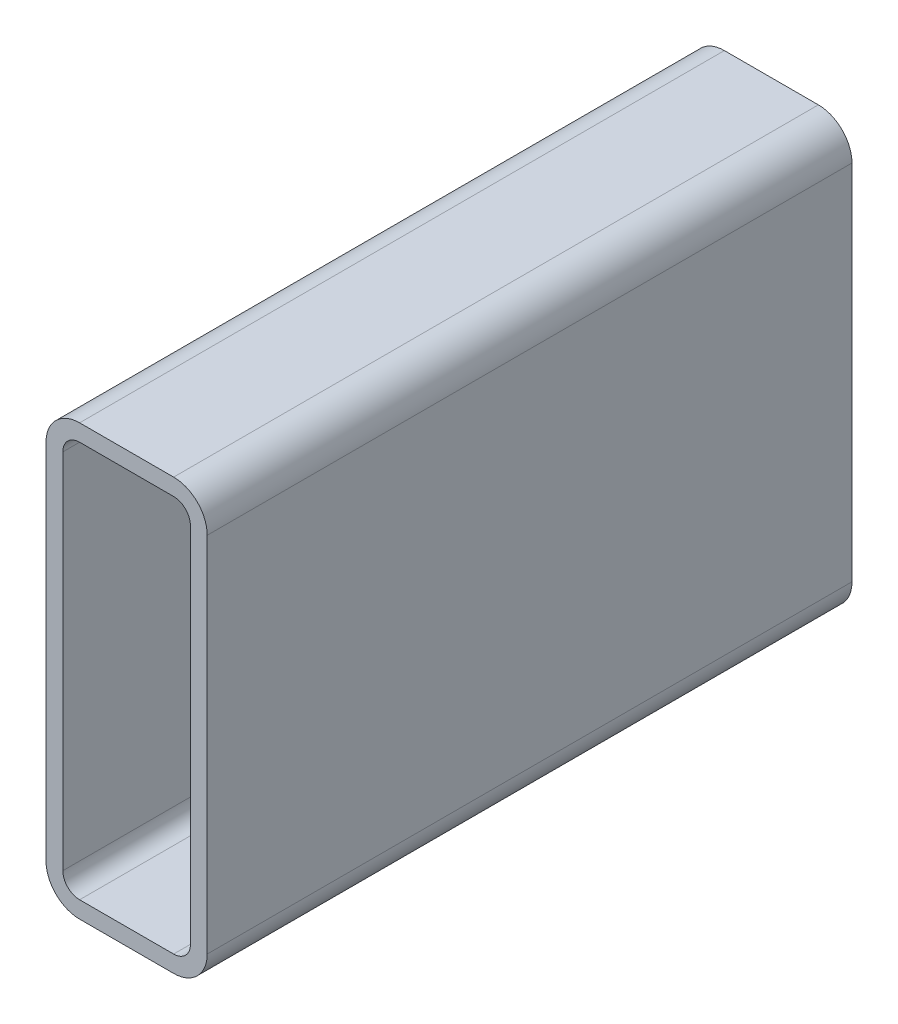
ISO-10303-21;
HEADER;
FILE_DESCRIPTION(('STEP AP214'),'2;1');
FILE_NAME('part.step','',(''),(''),'','','');
FILE_SCHEMA(('AUTOMOTIVE_DESIGN { 1 0 10303 214 1 1 1 1 }'));
ENDSEC;
DATA;
#1=APPLICATION_CONTEXT('core data for automotive mechanical design processes');
#2=APPLICATION_PROTOCOL_DEFINITION('international standard','automotive_design',2000,#1);
#3=PRODUCT_CONTEXT('',#1,'mechanical');
#4=PRODUCT('Part','Part','',(#3));
#5=PRODUCT_RELATED_PRODUCT_CATEGORY('part','',(#4));
#6=PRODUCT_DEFINITION_FORMATION('','',#4);
#7=PRODUCT_DEFINITION_CONTEXT('part definition',#1,'design');
#8=PRODUCT_DEFINITION('design','',#6,#7);
#9=PRODUCT_DEFINITION_SHAPE('','',#8);
#10=(LENGTH_UNIT() NAMED_UNIT(*) SI_UNIT(.MILLI.,.METRE.));
#11=(NAMED_UNIT(*) PLANE_ANGLE_UNIT() SI_UNIT($,.RADIAN.));
#12=(NAMED_UNIT(*) SI_UNIT($,.STERADIAN.) SOLID_ANGLE_UNIT());
#13=UNCERTAINTY_MEASURE_WITH_UNIT(LENGTH_MEASURE(1.E-05),#10,'distance_accuracy_value','');
#14=(GEOMETRIC_REPRESENTATION_CONTEXT(3) GLOBAL_UNCERTAINTY_ASSIGNED_CONTEXT((#13)) GLOBAL_UNIT_ASSIGNED_CONTEXT((#10,
#11,#12)) REPRESENTATION_CONTEXT('',''));
#15=CARTESIAN_POINT('',(0.,0.,0.));
#16=DIRECTION('',(0.,0.,1.));
#17=DIRECTION('',(1.,0.,0.));
#18=AXIS2_PLACEMENT_3D('',#15,#16,#17);
#19=CARTESIAN_POINT('',(18.3641160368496,189.291130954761,304.8));
#20=DIRECTION('',(0.,0.,1.));
#21=DIRECTION('',(1.,0.,0.));
#22=AXIS2_PLACEMENT_3D('',#19,#20,#21);
#23=PLANE('',#22);
#24=CARTESIAN_POINT('',(18.3641160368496,189.291130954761,304.8));
#25=DIRECTION('',(0.,0.,1.));
#26=DIRECTION('',(1.,0.,0.));
#27=AXIS2_PLACEMENT_3D('',#24,#25,#26);
#28=CIRCLE('',#27,15.875);
#29=CARTESIAN_POINT('',(18.3641160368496,205.166130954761,304.8));
#30=VERTEX_POINT('',#29);
#31=CARTESIAN_POINT('',(2.48911603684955,189.291130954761,304.8));
#32=VERTEX_POINT('',#31);
#33=EDGE_CURVE('E211',#30,#32,#28,.T.);
#34=ORIENTED_EDGE('',*,*,#33,.T.);
#35=DIRECTION('',(0.,-1.,0.));
#36=VECTOR('',#35,1.);
#37=CARTESIAN_POINT('',(2.48911603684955,17.8411309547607,304.8));
#38=LINE('',#37,#36);
#39=CARTESIAN_POINT('',(2.48911603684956,17.8411309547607,304.8));
#40=VERTEX_POINT('',#39);
#41=EDGE_CURVE('E214',#32,#40,#38,.T.);
#42=ORIENTED_EDGE('',*,*,#41,.T.);
#43=CARTESIAN_POINT('',(18.3641160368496,17.8411309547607,304.8));
#44=DIRECTION('',(0.,0.,1.));
#45=DIRECTION('',(1.,0.,0.));
#46=AXIS2_PLACEMENT_3D('',#43,#44,#45);
#47=CIRCLE('',#46,15.875);
#48=CARTESIAN_POINT('',(18.3641160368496,1.96613095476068,304.8));
#49=VERTEX_POINT('',#48);
#50=EDGE_CURVE('E217',#40,#49,#47,.T.);
#51=ORIENTED_EDGE('',*,*,#50,.T.);
#52=DIRECTION('',(1.,0.,0.));
#53=VECTOR('',#52,1.);
#54=CARTESIAN_POINT('',(62.8141160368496,1.96613095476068,304.8));
#55=LINE('',#54,#53);
#56=CARTESIAN_POINT('',(62.8141160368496,1.96613095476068,304.8));
#57=VERTEX_POINT('',#56);
#58=EDGE_CURVE('E219',#49,#57,#55,.T.);
#59=ORIENTED_EDGE('',*,*,#58,.T.);
#60=CARTESIAN_POINT('',(62.8141160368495,17.8411309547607,304.8));
#61=DIRECTION('',(0.,0.,1.));
#62=DIRECTION('',(1.,0.,0.));
#63=AXIS2_PLACEMENT_3D('',#60,#61,#62);
#64=CIRCLE('',#63,15.875);
#65=CARTESIAN_POINT('',(78.6891160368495,17.8411309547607,304.8));
#66=VERTEX_POINT('',#65);
#67=EDGE_CURVE('E221',#57,#66,#64,.T.);
#68=ORIENTED_EDGE('',*,*,#67,.T.);
#69=DIRECTION('',(0.,1.,0.));
#70=VECTOR('',#69,1.);
#71=CARTESIAN_POINT('',(78.6891160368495,189.291130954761,304.8));
#72=LINE('',#71,#70);
#73=CARTESIAN_POINT('',(78.6891160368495,189.291130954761,304.8));
#74=VERTEX_POINT('',#73);
#75=EDGE_CURVE('E223',#66,#74,#72,.T.);
#76=ORIENTED_EDGE('',*,*,#75,.T.);
#77=CARTESIAN_POINT('',(62.8141160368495,189.291130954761,304.8));
#78=DIRECTION('',(0.,0.,1.));
#79=DIRECTION('',(1.,0.,0.));
#80=AXIS2_PLACEMENT_3D('',#77,#78,#79);
#81=CIRCLE('',#80,15.875);
#82=CARTESIAN_POINT('',(62.8141160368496,205.166130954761,304.8));
#83=VERTEX_POINT('',#82);
#84=EDGE_CURVE('E225',#74,#83,#81,.T.);
#85=ORIENTED_EDGE('',*,*,#84,.T.);
#86=DIRECTION('',(-1.,0.,0.));
#87=VECTOR('',#86,1.);
#88=CARTESIAN_POINT('',(18.3641160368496,205.166130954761,304.8));
#89=LINE('',#88,#87);
#90=EDGE_CURVE('E227',#83,#30,#89,.T.);
#91=ORIENTED_EDGE('',*,*,#90,.T.);
#92=EDGE_LOOP('',(#34,#42,#51,#59,#68,#76,#85,#91));
#93=FACE_BOUND('',#92,.T.);
#94=DIRECTION('',(0.,-1.,0.));
#95=VECTOR('',#94,1.);
#96=CARTESIAN_POINT('',(10.4266160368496,17.8411309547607,304.8));
#97=LINE('',#96,#95);
#98=CARTESIAN_POINT('',(10.4266160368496,189.291130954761,304.8));
#99=VERTEX_POINT('',#98);
#100=CARTESIAN_POINT('',(10.4266160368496,17.8411309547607,304.8));
#101=VERTEX_POINT('',#100);
#102=EDGE_CURVE('E154',#99,#101,#97,.T.);
#103=ORIENTED_EDGE('',*,*,#102,.F.);
#104=CARTESIAN_POINT('',(18.3641160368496,189.291130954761,304.8));
#105=DIRECTION('',(0.,0.,1.));
#106=DIRECTION('',(1.,0.,0.));
#107=AXIS2_PLACEMENT_3D('',#104,#105,#106);
#108=CIRCLE('',#107,7.9375);
#109=CARTESIAN_POINT('',(18.3641160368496,197.228630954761,304.8));
#110=VERTEX_POINT('',#109);
#111=EDGE_CURVE('E146',#110,#99,#108,.T.);
#112=ORIENTED_EDGE('',*,*,#111,.F.);
#113=DIRECTION('',(-1.,0.,0.));
#114=VECTOR('',#113,1.);
#115=CARTESIAN_POINT('',(18.3641160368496,197.228630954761,304.8));
#116=LINE('',#115,#114);
#117=CARTESIAN_POINT('',(62.8141160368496,197.228630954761,304.8));
#118=VERTEX_POINT('',#117);
#119=EDGE_CURVE('E179',#118,#110,#116,.T.);
#120=ORIENTED_EDGE('',*,*,#119,.F.);
#121=CARTESIAN_POINT('',(62.8141160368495,189.291130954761,304.8));
#122=DIRECTION('',(0.,0.,1.));
#123=DIRECTION('',(1.,0.,0.));
#124=AXIS2_PLACEMENT_3D('',#121,#122,#123);
#125=CIRCLE('',#124,7.9375);
#126=CARTESIAN_POINT('',(70.7516160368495,189.291130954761,304.8));
#127=VERTEX_POINT('',#126);
#128=EDGE_CURVE('E177',#127,#118,#125,.T.);
#129=ORIENTED_EDGE('',*,*,#128,.F.);
#130=DIRECTION('',(0.,1.,0.));
#131=VECTOR('',#130,1.);
#132=CARTESIAN_POINT('',(70.7516160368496,189.291130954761,304.8));
#133=LINE('',#132,#131);
#134=CARTESIAN_POINT('',(70.7516160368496,17.8411309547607,304.8));
#135=VERTEX_POINT('',#134);
#136=EDGE_CURVE('E175',#135,#127,#133,.T.);
#137=ORIENTED_EDGE('',*,*,#136,.F.);
#138=CARTESIAN_POINT('',(62.8141160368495,17.8411309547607,304.8));
#139=DIRECTION('',(0.,0.,1.));
#140=DIRECTION('',(1.,0.,0.));
#141=AXIS2_PLACEMENT_3D('',#138,#139,#140);
#142=CIRCLE('',#141,7.93750000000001);
#143=CARTESIAN_POINT('',(62.8141160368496,9.90363095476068,304.8));
#144=VERTEX_POINT('',#143);
#145=EDGE_CURVE('E173',#144,#135,#142,.T.);
#146=ORIENTED_EDGE('',*,*,#145,.F.);
#147=DIRECTION('',(1.,0.,0.));
#148=VECTOR('',#147,1.);
#149=CARTESIAN_POINT('',(62.8141160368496,9.90363095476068,304.8));
#150=LINE('',#149,#148);
#151=CARTESIAN_POINT('',(18.3641160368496,9.90363095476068,304.8));
#152=VERTEX_POINT('',#151);
#153=EDGE_CURVE('E169',#152,#144,#150,.T.);
#154=ORIENTED_EDGE('',*,*,#153,.F.);
#155=CARTESIAN_POINT('',(18.3641160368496,17.8411309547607,304.8));
#156=DIRECTION('',(0.,0.,1.));
#157=DIRECTION('',(1.,0.,0.));
#158=AXIS2_PLACEMENT_3D('',#155,#156,#157);
#159=CIRCLE('',#158,7.9375);
#160=EDGE_CURVE('E167',#101,#152,#159,.T.);
#161=ORIENTED_EDGE('',*,*,#160,.F.);
#162=EDGE_LOOP('',(#103,#112,#120,#129,#137,#146,#154,#161));
#163=FACE_BOUND('',#162,.T.);
#164=ADVANCED_FACE('F33',(#93,#163),#23,.T.);
#165=CARTESIAN_POINT('',(18.3641160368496,189.291130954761,0.));
#166=DIRECTION('',(0.,0.,1.));
#167=DIRECTION('',(1.,0.,0.));
#168=AXIS2_PLACEMENT_3D('',#165,#166,#167);
#169=PLANE('',#168);
#170=CARTESIAN_POINT('',(18.3641160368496,189.291130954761,0.));
#171=DIRECTION('',(0.,0.,1.));
#172=DIRECTION('',(1.,0.,0.));
#173=AXIS2_PLACEMENT_3D('',#170,#171,#172);
#174=CIRCLE('',#173,15.875);
#175=CARTESIAN_POINT('',(18.3641160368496,205.166130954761,0.));
#176=VERTEX_POINT('',#175);
#177=CARTESIAN_POINT('',(2.48911603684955,189.291130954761,0.));
#178=VERTEX_POINT('',#177);
#179=EDGE_CURVE('E162',#176,#178,#174,.T.);
#180=ORIENTED_EDGE('',*,*,#179,.F.);
#181=DIRECTION('',(-1.,0.,0.));
#182=VECTOR('',#181,1.);
#183=CARTESIAN_POINT('',(18.3641160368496,205.166130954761,0.));
#184=LINE('',#183,#182);
#185=CARTESIAN_POINT('',(62.8141160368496,205.166130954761,0.));
#186=VERTEX_POINT('',#185);
#187=EDGE_CURVE('E215',#186,#176,#184,.T.);
#188=ORIENTED_EDGE('',*,*,#187,.F.);
#189=CARTESIAN_POINT('',(62.8141160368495,189.291130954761,0.));
#190=DIRECTION('',(0.,0.,1.));
#191=DIRECTION('',(1.,0.,0.));
#192=AXIS2_PLACEMENT_3D('',#189,#190,#191);
#193=CIRCLE('',#192,15.875);
#194=CARTESIAN_POINT('',(78.6891160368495,189.291130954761,0.));
#195=VERTEX_POINT('',#194);
#196=EDGE_CURVE('E242',#195,#186,#193,.T.);
#197=ORIENTED_EDGE('',*,*,#196,.F.);
#198=DIRECTION('',(0.,1.,0.));
#199=VECTOR('',#198,1.);
#200=CARTESIAN_POINT('',(78.6891160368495,189.291130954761,0.));
#201=LINE('',#200,#199);
#202=CARTESIAN_POINT('',(78.6891160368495,17.8411309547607,0.));
#203=VERTEX_POINT('',#202);
#204=EDGE_CURVE('E240',#203,#195,#201,.T.);
#205=ORIENTED_EDGE('',*,*,#204,.F.);
#206=CARTESIAN_POINT('',(62.8141160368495,17.8411309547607,0.));
#207=DIRECTION('',(0.,0.,1.));
#208=DIRECTION('',(1.,0.,0.));
#209=AXIS2_PLACEMENT_3D('',#206,#207,#208);
#210=CIRCLE('',#209,15.875);
#211=CARTESIAN_POINT('',(62.8141160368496,1.96613095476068,0.));
#212=VERTEX_POINT('',#211);
#213=EDGE_CURVE('E238',#212,#203,#210,.T.);
#214=ORIENTED_EDGE('',*,*,#213,.F.);
#215=DIRECTION('',(1.,0.,0.));
#216=VECTOR('',#215,1.);
#217=CARTESIAN_POINT('',(62.8141160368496,1.96613095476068,0.));
#218=LINE('',#217,#216);
#219=CARTESIAN_POINT('',(18.3641160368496,1.96613095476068,0.));
#220=VERTEX_POINT('',#219);
#221=EDGE_CURVE('E236',#220,#212,#218,.T.);
#222=ORIENTED_EDGE('',*,*,#221,.F.);
#223=CARTESIAN_POINT('',(18.3641160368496,17.8411309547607,0.));
#224=DIRECTION('',(0.,0.,1.));
#225=DIRECTION('',(1.,0.,0.));
#226=AXIS2_PLACEMENT_3D('',#223,#224,#225);
#227=CIRCLE('',#226,15.875);
#228=CARTESIAN_POINT('',(2.48911603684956,17.8411309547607,0.));
#229=VERTEX_POINT('',#228);
#230=EDGE_CURVE('E234',#229,#220,#227,.T.);
#231=ORIENTED_EDGE('',*,*,#230,.F.);
#232=DIRECTION('',(0.,-1.,0.));
#233=VECTOR('',#232,1.);
#234=CARTESIAN_POINT('',(2.48911603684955,17.8411309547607,0.));
#235=LINE('',#234,#233);
#236=EDGE_CURVE('E232',#178,#229,#235,.T.);
#237=ORIENTED_EDGE('',*,*,#236,.F.);
#238=EDGE_LOOP('',(#180,#188,#197,#205,#214,#222,#231,#237));
#239=FACE_BOUND('',#238,.T.);
#240=CARTESIAN_POINT('',(18.3641160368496,189.291130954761,0.));
#241=DIRECTION('',(0.,0.,1.));
#242=DIRECTION('',(1.,0.,0.));
#243=AXIS2_PLACEMENT_3D('',#240,#241,#242);
#244=CIRCLE('',#243,7.9375);
#245=CARTESIAN_POINT('',(18.3641160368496,197.228630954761,0.));
#246=VERTEX_POINT('',#245);
#247=CARTESIAN_POINT('',(10.4266160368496,189.291130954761,0.));
#248=VERTEX_POINT('',#247);
#249=EDGE_CURVE('E56',#246,#248,#244,.T.);
#250=ORIENTED_EDGE('',*,*,#249,.T.);
#251=DIRECTION('',(0.,-1.,0.));
#252=VECTOR('',#251,1.);
#253=CARTESIAN_POINT('',(10.4266160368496,17.8411309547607,0.));
#254=LINE('',#253,#252);
#255=CARTESIAN_POINT('',(10.4266160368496,17.8411309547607,0.));
#256=VERTEX_POINT('',#255);
#257=EDGE_CURVE('E161',#248,#256,#254,.T.);
#258=ORIENTED_EDGE('',*,*,#257,.T.);
#259=CARTESIAN_POINT('',(18.3641160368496,17.8411309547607,0.));
#260=DIRECTION('',(0.,0.,1.));
#261=DIRECTION('',(1.,0.,0.));
#262=AXIS2_PLACEMENT_3D('',#259,#260,#261);
#263=CIRCLE('',#262,7.9375);
#264=CARTESIAN_POINT('',(18.3641160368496,9.90363095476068,0.));
#265=VERTEX_POINT('',#264);
#266=EDGE_CURVE('E183',#256,#265,#263,.T.);
#267=ORIENTED_EDGE('',*,*,#266,.T.);
#268=DIRECTION('',(1.,0.,0.));
#269=VECTOR('',#268,1.);
#270=CARTESIAN_POINT('',(62.8141160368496,9.90363095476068,0.));
#271=LINE('',#270,#269);
#272=CARTESIAN_POINT('',(62.8141160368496,9.90363095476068,0.));
#273=VERTEX_POINT('',#272);
#274=EDGE_CURVE('E186',#265,#273,#271,.T.);
#275=ORIENTED_EDGE('',*,*,#274,.T.);
#276=CARTESIAN_POINT('',(62.8141160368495,17.8411309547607,0.));
#277=DIRECTION('',(0.,0.,1.));
#278=DIRECTION('',(1.,0.,0.));
#279=AXIS2_PLACEMENT_3D('',#276,#277,#278);
#280=CIRCLE('',#279,7.93750000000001);
#281=CARTESIAN_POINT('',(70.7516160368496,17.8411309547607,0.));
#282=VERTEX_POINT('',#281);
#283=EDGE_CURVE('E189',#273,#282,#280,.T.);
#284=ORIENTED_EDGE('',*,*,#283,.T.);
#285=DIRECTION('',(0.,1.,0.));
#286=VECTOR('',#285,1.);
#287=CARTESIAN_POINT('',(70.7516160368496,189.291130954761,0.));
#288=LINE('',#287,#286);
#289=CARTESIAN_POINT('',(70.7516160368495,189.291130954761,0.));
#290=VERTEX_POINT('',#289);
#291=EDGE_CURVE('E192',#282,#290,#288,.T.);
#292=ORIENTED_EDGE('',*,*,#291,.T.);
#293=CARTESIAN_POINT('',(62.8141160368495,189.291130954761,0.));
#294=DIRECTION('',(0.,0.,1.));
#295=DIRECTION('',(1.,0.,0.));
#296=AXIS2_PLACEMENT_3D('',#293,#294,#295);
#297=CIRCLE('',#296,7.9375);
#298=CARTESIAN_POINT('',(62.8141160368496,197.228630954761,0.));
#299=VERTEX_POINT('',#298);
#300=EDGE_CURVE('E195',#290,#299,#297,.T.);
#301=ORIENTED_EDGE('',*,*,#300,.T.);
#302=DIRECTION('',(-1.,0.,0.));
#303=VECTOR('',#302,1.);
#304=CARTESIAN_POINT('',(18.3641160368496,197.228630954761,0.));
#305=LINE('',#304,#303);
#306=EDGE_CURVE('E155',#299,#246,#305,.T.);
#307=ORIENTED_EDGE('',*,*,#306,.T.);
#308=EDGE_LOOP('',(#250,#258,#267,#275,#284,#292,#301,#307));
#309=FACE_BOUND('',#308,.T.);
#310=ADVANCED_FACE('F272',(#239,#309),#169,.F.);
#311=CARTESIAN_POINT('',(18.3641160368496,189.291130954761,304.8));
#312=DIRECTION('',(0.,0.,-1.));
#313=DIRECTION('',(-1.,0.,0.));
#314=AXIS2_PLACEMENT_3D('',#311,#312,#313);
#315=CYLINDRICAL_SURFACE('',#314,15.875);
#316=ORIENTED_EDGE('',*,*,#179,.T.);
#317=DIRECTION('',(0.,0.,-1.));
#318=VECTOR('',#317,1.);
#319=CARTESIAN_POINT('',(2.48911603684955,189.291130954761,304.8));
#320=LINE('',#319,#318);
#321=EDGE_CURVE('E11',#32,#178,#320,.T.);
#322=ORIENTED_EDGE('',*,*,#321,.F.);
#323=ORIENTED_EDGE('',*,*,#33,.F.);
#324=DIRECTION('',(0.,0.,-1.));
#325=VECTOR('',#324,1.);
#326=CARTESIAN_POINT('',(18.3641160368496,205.166130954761,304.8));
#327=LINE('',#326,#325);
#328=EDGE_CURVE('E229',#30,#176,#327,.T.);
#329=ORIENTED_EDGE('',*,*,#328,.T.);
#330=EDGE_LOOP('',(#316,#322,#323,#329));
#331=FACE_BOUND('',#330,.T.);
#332=ADVANCED_FACE('F35',(#331),#315,.T.);
#333=CARTESIAN_POINT('',(2.48911603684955,17.8411309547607,304.8));
#334=DIRECTION('',(1.,0.,0.));
#335=DIRECTION('',(0.,0.,-1.));
#336=AXIS2_PLACEMENT_3D('',#333,#334,#335);
#337=PLANE('',#336);
#338=ORIENTED_EDGE('',*,*,#236,.T.);
#339=DIRECTION('',(0.,0.,-1.));
#340=VECTOR('',#339,1.);
#341=CARTESIAN_POINT('',(2.48911603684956,17.8411309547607,304.8));
#342=LINE('',#341,#340);
#343=EDGE_CURVE('E41',#40,#229,#342,.T.);
#344=ORIENTED_EDGE('',*,*,#343,.F.);
#345=ORIENTED_EDGE('',*,*,#41,.F.);
#346=ORIENTED_EDGE('',*,*,#321,.T.);
#347=EDGE_LOOP('',(#338,#344,#345,#346));
#348=FACE_BOUND('',#347,.T.);
#349=ADVANCED_FACE('F289',(#348),#337,.F.);
#350=CARTESIAN_POINT('',(18.3641160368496,17.8411309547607,304.8));
#351=DIRECTION('',(0.,0.,-1.));
#352=DIRECTION('',(-1.,0.,0.));
#353=AXIS2_PLACEMENT_3D('',#350,#351,#352);
#354=CYLINDRICAL_SURFACE('',#353,15.875);
#355=ORIENTED_EDGE('',*,*,#230,.T.);
#356=DIRECTION('',(0.,0.,-1.));
#357=VECTOR('',#356,1.);
#358=CARTESIAN_POINT('',(18.3641160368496,1.96613095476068,304.8));
#359=LINE('',#358,#357);
#360=EDGE_CURVE('E259',#49,#220,#359,.T.);
#361=ORIENTED_EDGE('',*,*,#360,.F.);
#362=ORIENTED_EDGE('',*,*,#50,.F.);
#363=ORIENTED_EDGE('',*,*,#343,.T.);
#364=EDGE_LOOP('',(#355,#361,#362,#363));
#365=FACE_BOUND('',#364,.T.);
#366=ADVANCED_FACE('F266',(#365),#354,.T.);
#367=CARTESIAN_POINT('',(62.8141160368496,1.96613095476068,304.8));
#368=DIRECTION('',(0.,1.,0.));
#369=DIRECTION('',(0.,0.,1.));
#370=AXIS2_PLACEMENT_3D('',#367,#368,#369);
#371=PLANE('',#370);
#372=ORIENTED_EDGE('',*,*,#221,.T.);
#373=DIRECTION('',(0.,0.,-1.));
#374=VECTOR('',#373,1.);
#375=CARTESIAN_POINT('',(62.8141160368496,1.96613095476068,304.8));
#376=LINE('',#375,#374);
#377=EDGE_CURVE('E256',#57,#212,#376,.T.);
#378=ORIENTED_EDGE('',*,*,#377,.F.);
#379=ORIENTED_EDGE('',*,*,#58,.F.);
#380=ORIENTED_EDGE('',*,*,#360,.T.);
#381=EDGE_LOOP('',(#372,#378,#379,#380));
#382=FACE_BOUND('',#381,.T.);
#383=ADVANCED_FACE('F278',(#382),#371,.F.);
#384=CARTESIAN_POINT('',(62.8141160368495,17.8411309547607,304.8));
#385=DIRECTION('',(0.,0.,-1.));
#386=DIRECTION('',(-1.,0.,0.));
#387=AXIS2_PLACEMENT_3D('',#384,#385,#386);
#388=CYLINDRICAL_SURFACE('',#387,15.875);
#389=ORIENTED_EDGE('',*,*,#213,.T.);
#390=DIRECTION('',(0.,0.,-1.));
#391=VECTOR('',#390,1.);
#392=CARTESIAN_POINT('',(78.6891160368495,17.8411309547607,304.8));
#393=LINE('',#392,#391);
#394=EDGE_CURVE('E253',#66,#203,#393,.T.);
#395=ORIENTED_EDGE('',*,*,#394,.F.);
#396=ORIENTED_EDGE('',*,*,#67,.F.);
#397=ORIENTED_EDGE('',*,*,#377,.T.);
#398=EDGE_LOOP('',(#389,#395,#396,#397));
#399=FACE_BOUND('',#398,.T.);
#400=ADVANCED_FACE('F282',(#399),#388,.T.);
#401=CARTESIAN_POINT('',(78.6891160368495,189.291130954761,304.8));
#402=DIRECTION('',(-1.,0.,0.));
#403=DIRECTION('',(0.,0.,1.));
#404=AXIS2_PLACEMENT_3D('',#401,#402,#403);
#405=PLANE('',#404);
#406=ORIENTED_EDGE('',*,*,#204,.T.);
#407=DIRECTION('',(0.,0.,-1.));
#408=VECTOR('',#407,1.);
#409=CARTESIAN_POINT('',(78.6891160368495,189.291130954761,304.8));
#410=LINE('',#409,#408);
#411=EDGE_CURVE('E250',#74,#195,#410,.T.);
#412=ORIENTED_EDGE('',*,*,#411,.F.);
#413=ORIENTED_EDGE('',*,*,#75,.F.);
#414=ORIENTED_EDGE('',*,*,#394,.T.);
#415=EDGE_LOOP('',(#406,#412,#413,#414));
#416=FACE_BOUND('',#415,.T.);
#417=ADVANCED_FACE('F302',(#416),#405,.F.);
#418=CARTESIAN_POINT('',(62.8141160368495,189.291130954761,304.8));
#419=DIRECTION('',(0.,0.,-1.));
#420=DIRECTION('',(-1.,0.,0.));
#421=AXIS2_PLACEMENT_3D('',#418,#419,#420);
#422=CYLINDRICAL_SURFACE('',#421,15.875);
#423=ORIENTED_EDGE('',*,*,#196,.T.);
#424=DIRECTION('',(0.,0.,-1.));
#425=VECTOR('',#424,1.);
#426=CARTESIAN_POINT('',(62.8141160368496,205.166130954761,304.8));
#427=LINE('',#426,#425);
#428=EDGE_CURVE('E247',#83,#186,#427,.T.);
#429=ORIENTED_EDGE('',*,*,#428,.F.);
#430=ORIENTED_EDGE('',*,*,#84,.F.);
#431=ORIENTED_EDGE('',*,*,#411,.T.);
#432=EDGE_LOOP('',(#423,#429,#430,#431));
#433=FACE_BOUND('',#432,.T.);
#434=ADVANCED_FACE('F300',(#433),#422,.T.);
#435=CARTESIAN_POINT('',(18.3641160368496,205.166130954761,304.8));
#436=DIRECTION('',(0.,-1.,0.));
#437=DIRECTION('',(0.,0.,-1.));
#438=AXIS2_PLACEMENT_3D('',#435,#436,#437);
#439=PLANE('',#438);
#440=ORIENTED_EDGE('',*,*,#187,.T.);
#441=ORIENTED_EDGE('',*,*,#328,.F.);
#442=ORIENTED_EDGE('',*,*,#90,.F.);
#443=ORIENTED_EDGE('',*,*,#428,.T.);
#444=EDGE_LOOP('',(#440,#441,#442,#443));
#445=FACE_BOUND('',#444,.T.);
#446=ADVANCED_FACE('F295',(#445),#439,.F.);
#447=CARTESIAN_POINT('',(18.3641160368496,189.291130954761,304.8));
#448=DIRECTION('',(0.,0.,-1.));
#449=DIRECTION('',(-1.,0.,0.));
#450=AXIS2_PLACEMENT_3D('',#447,#448,#449);
#451=CYLINDRICAL_SURFACE('',#450,7.9375);
#452=ORIENTED_EDGE('',*,*,#249,.F.);
#453=DIRECTION('',(0.,0.,-1.));
#454=VECTOR('',#453,1.);
#455=CARTESIAN_POINT('',(18.3641160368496,197.228630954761,304.8));
#456=LINE('',#455,#454);
#457=EDGE_CURVE('E150',#110,#246,#456,.T.);
#458=ORIENTED_EDGE('',*,*,#457,.F.);
#459=ORIENTED_EDGE('',*,*,#111,.T.);
#460=DIRECTION('',(0.,0.,-1.));
#461=VECTOR('',#460,1.);
#462=CARTESIAN_POINT('',(10.4266160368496,189.291130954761,304.8));
#463=LINE('',#462,#461);
#464=EDGE_CURVE('E149',#99,#248,#463,.T.);
#465=ORIENTED_EDGE('',*,*,#464,.T.);
#466=EDGE_LOOP('',(#452,#458,#459,#465));
#467=FACE_BOUND('',#466,.T.);
#468=ADVANCED_FACE('F148',(#467),#451,.F.);
#469=CARTESIAN_POINT('',(10.4266160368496,17.8411309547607,304.8));
#470=DIRECTION('',(1.,0.,0.));
#471=DIRECTION('',(0.,0.,-1.));
#472=AXIS2_PLACEMENT_3D('',#469,#470,#471);
#473=PLANE('',#472);
#474=ORIENTED_EDGE('',*,*,#257,.F.);
#475=ORIENTED_EDGE('',*,*,#464,.F.);
#476=ORIENTED_EDGE('',*,*,#102,.T.);
#477=DIRECTION('',(0.,0.,-1.));
#478=VECTOR('',#477,1.);
#479=CARTESIAN_POINT('',(10.4266160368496,17.8411309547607,304.8));
#480=LINE('',#479,#478);
#481=EDGE_CURVE('E163',#101,#256,#480,.T.);
#482=ORIENTED_EDGE('',*,*,#481,.T.);
#483=EDGE_LOOP('',(#474,#475,#476,#482));
#484=FACE_BOUND('',#483,.T.);
#485=ADVANCED_FACE('F158',(#484),#473,.T.);
#486=CARTESIAN_POINT('',(18.3641160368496,17.8411309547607,304.8));
#487=DIRECTION('',(0.,0.,-1.));
#488=DIRECTION('',(-1.,0.,0.));
#489=AXIS2_PLACEMENT_3D('',#486,#487,#488);
#490=CYLINDRICAL_SURFACE('',#489,7.9375);
#491=ORIENTED_EDGE('',*,*,#266,.F.);
#492=ORIENTED_EDGE('',*,*,#481,.F.);
#493=ORIENTED_EDGE('',*,*,#160,.T.);
#494=DIRECTION('',(0.,0.,-1.));
#495=VECTOR('',#494,1.);
#496=CARTESIAN_POINT('',(18.3641160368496,9.90363095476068,304.8));
#497=LINE('',#496,#495);
#498=EDGE_CURVE('E208',#152,#265,#497,.T.);
#499=ORIENTED_EDGE('',*,*,#498,.T.);
#500=EDGE_LOOP('',(#491,#492,#493,#499));
#501=FACE_BOUND('',#500,.T.);
#502=ADVANCED_FACE('F327',(#501),#490,.F.);
#503=CARTESIAN_POINT('',(62.8141160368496,9.90363095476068,304.8));
#504=DIRECTION('',(0.,1.,0.));
#505=DIRECTION('',(0.,0.,1.));
#506=AXIS2_PLACEMENT_3D('',#503,#504,#505);
#507=PLANE('',#506);
#508=ORIENTED_EDGE('',*,*,#274,.F.);
#509=ORIENTED_EDGE('',*,*,#498,.F.);
#510=ORIENTED_EDGE('',*,*,#153,.T.);
#511=DIRECTION('',(0.,0.,-1.));
#512=VECTOR('',#511,1.);
#513=CARTESIAN_POINT('',(62.8141160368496,9.90363095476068,304.8));
#514=LINE('',#513,#512);
#515=EDGE_CURVE('E206',#144,#273,#514,.T.);
#516=ORIENTED_EDGE('',*,*,#515,.T.);
#517=EDGE_LOOP('',(#508,#509,#510,#516));
#518=FACE_BOUND('',#517,.T.);
#519=ADVANCED_FACE('F331',(#518),#507,.T.);
#520=CARTESIAN_POINT('',(62.8141160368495,17.8411309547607,304.8));
#521=DIRECTION('',(0.,0.,-1.));
#522=DIRECTION('',(-1.,0.,0.));
#523=AXIS2_PLACEMENT_3D('',#520,#521,#522);
#524=CYLINDRICAL_SURFACE('',#523,7.93750000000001);
#525=ORIENTED_EDGE('',*,*,#283,.F.);
#526=ORIENTED_EDGE('',*,*,#515,.F.);
#527=ORIENTED_EDGE('',*,*,#145,.T.);
#528=DIRECTION('',(0.,0.,-1.));
#529=VECTOR('',#528,1.);
#530=CARTESIAN_POINT('',(70.7516160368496,17.8411309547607,304.8));
#531=LINE('',#530,#529);
#532=EDGE_CURVE('E204',#135,#282,#531,.T.);
#533=ORIENTED_EDGE('',*,*,#532,.T.);
#534=EDGE_LOOP('',(#525,#526,#527,#533));
#535=FACE_BOUND('',#534,.T.);
#536=ADVANCED_FACE('F337',(#535),#524,.F.);
#537=CARTESIAN_POINT('',(70.7516160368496,189.291130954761,304.8));
#538=DIRECTION('',(-1.,0.,0.));
#539=DIRECTION('',(0.,0.,1.));
#540=AXIS2_PLACEMENT_3D('',#537,#538,#539);
#541=PLANE('',#540);
#542=ORIENTED_EDGE('',*,*,#291,.F.);
#543=ORIENTED_EDGE('',*,*,#532,.F.);
#544=ORIENTED_EDGE('',*,*,#136,.T.);
#545=DIRECTION('',(0.,0.,-1.));
#546=VECTOR('',#545,1.);
#547=CARTESIAN_POINT('',(70.7516160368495,189.291130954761,304.8));
#548=LINE('',#547,#546);
#549=EDGE_CURVE('E202',#127,#290,#548,.T.);
#550=ORIENTED_EDGE('',*,*,#549,.T.);
#551=EDGE_LOOP('',(#542,#543,#544,#550));
#552=FACE_BOUND('',#551,.T.);
#553=ADVANCED_FACE('F341',(#552),#541,.T.);
#554=CARTESIAN_POINT('',(62.8141160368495,189.291130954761,304.8));
#555=DIRECTION('',(0.,0.,-1.));
#556=DIRECTION('',(-1.,0.,0.));
#557=AXIS2_PLACEMENT_3D('',#554,#555,#556);
#558=CYLINDRICAL_SURFACE('',#557,7.9375);
#559=ORIENTED_EDGE('',*,*,#300,.F.);
#560=ORIENTED_EDGE('',*,*,#549,.F.);
#561=ORIENTED_EDGE('',*,*,#128,.T.);
#562=DIRECTION('',(0.,0.,-1.));
#563=VECTOR('',#562,1.);
#564=CARTESIAN_POINT('',(62.8141160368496,197.228630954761,304.8));
#565=LINE('',#564,#563);
#566=EDGE_CURVE('E48',#118,#299,#565,.T.);
#567=ORIENTED_EDGE('',*,*,#566,.T.);
#568=EDGE_LOOP('',(#559,#560,#561,#567));
#569=FACE_BOUND('',#568,.T.);
#570=ADVANCED_FACE('F345',(#569),#558,.F.);
#571=CARTESIAN_POINT('',(18.3641160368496,197.228630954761,304.8));
#572=DIRECTION('',(0.,-1.,0.));
#573=DIRECTION('',(0.,0.,-1.));
#574=AXIS2_PLACEMENT_3D('',#571,#572,#573);
#575=PLANE('',#574);
#576=ORIENTED_EDGE('',*,*,#306,.F.);
#577=ORIENTED_EDGE('',*,*,#566,.F.);
#578=ORIENTED_EDGE('',*,*,#119,.T.);
#579=ORIENTED_EDGE('',*,*,#457,.T.);
#580=EDGE_LOOP('',(#576,#577,#578,#579));
#581=FACE_BOUND('',#580,.T.);
#582=ADVANCED_FACE('F349',(#581),#575,.T.);
#583=CLOSED_SHELL('',(#164,#310,#332,#349,#366,#383,#400,#417,#434,#446,#468,#485,#502,#519,
#536,#553,#570,#582));
#584=MANIFOLD_SOLID_BREP('B2',#583);
#585=ADVANCED_BREP_SHAPE_REPRESENTATION('',(#18,#584),#14);
#586=SHAPE_DEFINITION_REPRESENTATION(#9,#585);
ENDSEC;
END-ISO-10303-21;
